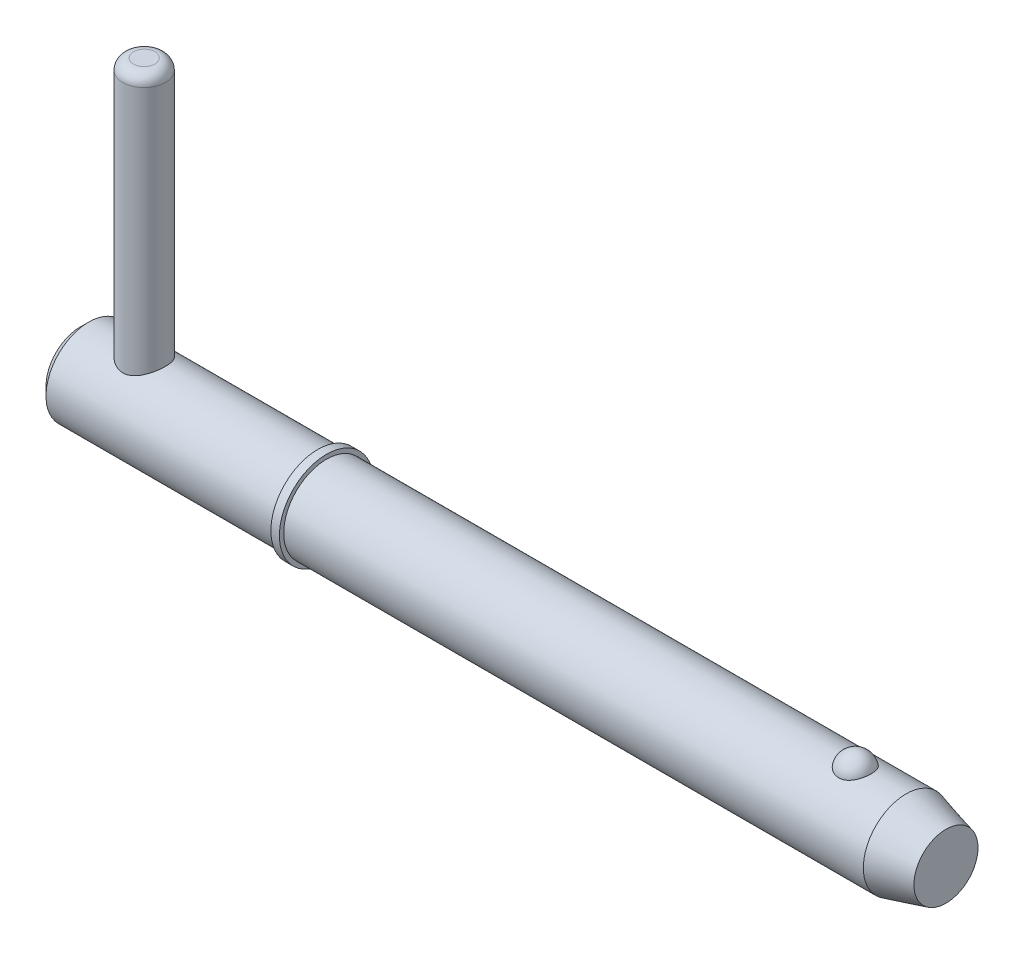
ISO-10303-21;
HEADER;
FILE_DESCRIPTION(('STEP AP214'),'2;1');
FILE_NAME('part.step','',(''),(''),'','','');
FILE_SCHEMA(('AUTOMOTIVE_DESIGN { 1 0 10303 214 1 1 1 1 }'));
ENDSEC;
DATA;
#1=APPLICATION_CONTEXT('core data for automotive mechanical design processes');
#2=APPLICATION_PROTOCOL_DEFINITION('international standard','automotive_design',2000,#1);
#3=PRODUCT_CONTEXT('',#1,'mechanical');
#4=PRODUCT('Part','Part','',(#3));
#5=PRODUCT_RELATED_PRODUCT_CATEGORY('part','',(#4));
#6=PRODUCT_DEFINITION_FORMATION('','',#4);
#7=PRODUCT_DEFINITION_CONTEXT('part definition',#1,'design');
#8=PRODUCT_DEFINITION('design','',#6,#7);
#9=PRODUCT_DEFINITION_SHAPE('','',#8);
#10=(LENGTH_UNIT() NAMED_UNIT(*) SI_UNIT(.MILLI.,.METRE.));
#11=(NAMED_UNIT(*) PLANE_ANGLE_UNIT() SI_UNIT($,.RADIAN.));
#12=(NAMED_UNIT(*) SI_UNIT($,.STERADIAN.) SOLID_ANGLE_UNIT());
#13=UNCERTAINTY_MEASURE_WITH_UNIT(LENGTH_MEASURE(1.E-05),#10,'distance_accuracy_value','');
#14=(GEOMETRIC_REPRESENTATION_CONTEXT(3) GLOBAL_UNCERTAINTY_ASSIGNED_CONTEXT((#13)) GLOBAL_UNIT_ASSIGNED_CONTEXT((#10,
#11,#12)) REPRESENTATION_CONTEXT('',''));
#15=CARTESIAN_POINT('',(0.,0.,0.));
#16=DIRECTION('',(0.,0.,1.));
#17=DIRECTION('',(1.,0.,0.));
#18=AXIS2_PLACEMENT_3D('',#15,#16,#17);
#19=CARTESIAN_POINT('',(4.755,22.225,0.));
#20=DIRECTION('',(0.,-1.,0.));
#21=DIRECTION('',(0.,0.,-1.));
#22=AXIS2_PLACEMENT_3D('',#19,#20,#21);
#23=CYLINDRICAL_SURFACE('',#22,1.585);
#24=CARTESIAN_POINT('',(4.755,-2.3825,0.));
#25=DIRECTION('',(0.,1.,0.));
#26=DIRECTION('',(0.,0.,1.));
#27=AXIS2_PLACEMENT_3D('',#24,#25,#26);
#28=CIRCLE('',#27,1.585);
#29=CARTESIAN_POINT('',(4.755,-2.3825,1.585));
#30=VERTEX_POINT('',#29);
#31=EDGE_CURVE('P0_E25',#30,#30,#28,.T.);
#32=ORIENTED_EDGE('',*,*,#31,.T.);
#33=EDGE_LOOP('',(#32));
#34=FACE_BOUND('',#33,.T.);
#35=CARTESIAN_POINT('',(4.755,21.4325,0.));
#36=DIRECTION('',(0.,1.,0.));
#37=DIRECTION('',(0.,0.,1.));
#38=AXIS2_PLACEMENT_3D('',#35,#36,#37);
#39=CIRCLE('',#38,1.585);
#40=CARTESIAN_POINT('',(4.755,21.4325,1.585));
#41=VERTEX_POINT('',#40);
#42=EDGE_CURVE('P0_E29',#41,#41,#39,.F.);
#43=ORIENTED_EDGE('',*,*,#42,.T.);
#44=EDGE_LOOP('',(#43));
#45=FACE_BOUND('',#44,.T.);
#46=ADVANCED_FACE('P0_F14',(#34,#45),#23,.T.);
#47=CARTESIAN_POINT('',(4.755,22.225,0.));
#48=DIRECTION('',(0.,1.,0.));
#49=DIRECTION('',(0.,0.,1.));
#50=AXIS2_PLACEMENT_3D('',#47,#48,#49);
#51=PLANE('',#50);
#52=CARTESIAN_POINT('',(4.755,22.225,0.));
#53=DIRECTION('',(0.,1.,0.));
#54=DIRECTION('',(0.,0.,1.));
#55=AXIS2_PLACEMENT_3D('',#52,#53,#54);
#56=CIRCLE('',#55,0.7925);
#57=CARTESIAN_POINT('',(4.755,22.225,0.7925));
#58=VERTEX_POINT('',#57);
#59=EDGE_CURVE('P0_E10',#58,#58,#56,.T.);
#60=ORIENTED_EDGE('',*,*,#59,.T.);
#61=EDGE_LOOP('',(#60));
#62=FACE_BOUND('',#61,.T.);
#63=ADVANCED_FACE('P0_F46',(#62),#51,.T.);
#64=CARTESIAN_POINT('',(4.755,-3.175,0.));
#65=DIRECTION('',(0.,1.,0.));
#66=DIRECTION('',(0.,0.,1.));
#67=AXIS2_PLACEMENT_3D('',#64,#65,#66);
#68=PLANE('',#67);
#69=CARTESIAN_POINT('',(4.755,-3.175,0.));
#70=DIRECTION('',(0.,1.,0.));
#71=DIRECTION('',(0.,0.,1.));
#72=AXIS2_PLACEMENT_3D('',#69,#70,#71);
#73=CIRCLE('',#72,0.7925);
#74=CARTESIAN_POINT('',(4.755,-3.175,0.7925));
#75=VERTEX_POINT('',#74);
#76=EDGE_CURVE('P0_E21',#75,#75,#73,.F.);
#77=ORIENTED_EDGE('',*,*,#76,.T.);
#78=EDGE_LOOP('',(#77));
#79=FACE_BOUND('',#78,.T.);
#80=ADVANCED_FACE('P0_F43',(#79),#68,.F.);
#81=CARTESIAN_POINT('',(4.755,-2.3825,0.));
#82=DIRECTION('',(0.,1.,0.));
#83=DIRECTION('',(0.,0.,1.));
#84=AXIS2_PLACEMENT_3D('',#81,#82,#83);
#85=DEGENERATE_TOROIDAL_SURFACE('',#84,0.7925,0.7925,.T.);
#86=ORIENTED_EDGE('',*,*,#76,.F.);
#87=EDGE_LOOP('',(#86));
#88=FACE_BOUND('',#87,.T.);
#89=ORIENTED_EDGE('',*,*,#31,.F.);
#90=EDGE_LOOP('',(#89));
#91=FACE_BOUND('',#90,.T.);
#92=ADVANCED_FACE('P0_F38',(#88,#91),#85,.T.);
#93=CARTESIAN_POINT('',(4.755,21.4325,0.));
#94=DIRECTION('',(0.,1.,0.));
#95=DIRECTION('',(0.,0.,1.));
#96=AXIS2_PLACEMENT_3D('',#93,#94,#95);
#97=DEGENERATE_TOROIDAL_SURFACE('',#96,0.7925,0.7925,.T.);
#98=ORIENTED_EDGE('',*,*,#42,.F.);
#99=EDGE_LOOP('',(#98));
#100=FACE_BOUND('',#99,.T.);
#101=ORIENTED_EDGE('',*,*,#59,.F.);
#102=EDGE_LOOP('',(#101));
#103=FACE_BOUND('',#102,.T.);
#104=ADVANCED_FACE('P0_F16',(#100,#103),#97,.T.);
#105=CLOSED_SHELL('',(#46,#63,#80,#92,#104));
#106=MANIFOLD_SOLID_BREP('P0_B1',#105);
#107=CARTESIAN_POINT('',(0.,0.,0.));
#108=DIRECTION('',(1.,0.,0.));
#109=DIRECTION('',(0.,0.,-1.));
#110=AXIS2_PLACEMENT_3D('',#107,#108,#109);
#111=CYLINDRICAL_SURFACE('',#110,3.175);
#112=CARTESIAN_POINT('',(61.3476846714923,0.,0.));
#113=DIRECTION('',(1.,0.,0.));
#114=DIRECTION('',(0.,0.,-1.));
#115=AXIS2_PLACEMENT_3D('',#112,#113,#114);
#116=CIRCLE('',#115,3.175);
#117=CARTESIAN_POINT('',(61.3476846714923,0.,-3.175));
#118=VERTEX_POINT('',#117);
#119=EDGE_CURVE('P1_E81',#118,#118,#116,.T.);
#120=ORIENTED_EDGE('',*,*,#119,.F.);
#121=EDGE_LOOP('',(#120));
#122=FACE_BOUND('',#121,.T.);
#123=CARTESIAN_POINT('',(18.29,0.,0.));
#124=DIRECTION('',(1.,0.,0.));
#125=DIRECTION('',(0.,0.,-1.));
#126=AXIS2_PLACEMENT_3D('',#123,#124,#125);
#127=CIRCLE('',#126,3.175);
#128=CARTESIAN_POINT('',(18.29,0.,-3.175));
#129=VERTEX_POINT('',#128);
#130=EDGE_CURVE('P1_E85',#129,#129,#127,.T.);
#131=ORIENTED_EDGE('',*,*,#130,.T.);
#132=EDGE_LOOP('',(#131));
#133=FACE_BOUND('',#132,.T.);
#134=CARTESIAN_POINT('',(57.5757276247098,2.92898950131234,1.2254164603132));
#135=CARTESIAN_POINT('',(57.512316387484,2.92899434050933,1.22541146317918));
#136=CARTESIAN_POINT('',(57.4487979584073,2.93112688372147,1.22034641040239));
#137=CARTESIAN_POINT('',(57.3235306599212,2.93942752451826,1.2002094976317));
#138=CARTESIAN_POINT('',(57.2617869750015,2.9456063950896,1.1851109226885));
#139=CARTESIAN_POINT('',(57.1420651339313,2.96127115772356,1.14540352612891));
#140=CARTESIAN_POINT('',(57.0840775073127,2.97074831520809,1.12081980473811));
#141=CARTESIAN_POINT('',(56.9731943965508,2.99197584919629,1.06285154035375));
#142=CARTESIAN_POINT('',(56.9202966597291,3.0037252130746,1.02947091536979));
#143=CARTESIAN_POINT('',(56.8192688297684,3.02865714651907,0.95367409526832));
#144=CARTESIAN_POINT('',(56.771324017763,3.04187163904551,0.911021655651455));
#145=CARTESIAN_POINT('',(56.6830360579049,3.06808741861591,0.818400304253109));
#146=CARTESIAN_POINT('',(56.6426952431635,3.08108863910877,0.768429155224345));
#147=CARTESIAN_POINT('',(56.5688039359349,3.10614903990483,0.660064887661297));
#148=CARTESIAN_POINT('',(56.5356330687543,3.11814104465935,0.601396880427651));
#149=CARTESIAN_POINT('',(56.4791190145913,3.13926931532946,0.47902691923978));
#150=CARTESIAN_POINT('',(56.4557764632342,3.14840539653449,0.415324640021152));
#151=CARTESIAN_POINT('',(56.4191785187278,3.16298160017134,0.283885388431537));
#152=CARTESIAN_POINT('',(56.4060407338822,3.16837855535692,0.21611080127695));
#153=CARTESIAN_POINT('',(56.3905676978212,3.17475386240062,0.0791367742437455));
#154=CARTESIAN_POINT('',(56.388232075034,3.17573236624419,0.00993738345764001));
#155=CARTESIAN_POINT('',(56.3943886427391,3.17318075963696,-0.127420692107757));
#156=CARTESIAN_POINT('',(56.4028073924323,3.16968122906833,-0.195583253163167));
#157=CARTESIAN_POINT('',(56.4301752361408,3.1585790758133,-0.329413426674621));
#158=CARTESIAN_POINT('',(56.4491245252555,3.15097637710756,-0.395080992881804));
#159=CARTESIAN_POINT('',(56.4972057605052,3.13242485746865,-0.522180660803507));
#160=CARTESIAN_POINT('',(56.5263524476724,3.12147119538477,-0.583606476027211));
#161=CARTESIAN_POINT('',(56.5942352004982,3.09734973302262,-0.700436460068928));
#162=CARTESIAN_POINT('',(56.632972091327,3.08418174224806,-0.7558401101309));
#163=CARTESIAN_POINT('',(56.7194771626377,3.05694884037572,-0.859404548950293));
#164=CARTESIAN_POINT('',(56.7672961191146,3.04287919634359,-0.907521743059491));
#165=CARTESIAN_POINT('',(56.8707353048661,3.01548927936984,-0.994758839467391));
#166=CARTESIAN_POINT('',(56.9263549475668,3.0021689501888,-1.03387941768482));
#167=CARTESIAN_POINT('',(57.0428093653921,2.97810316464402,-1.10126594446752));
#168=CARTESIAN_POINT('',(57.1035182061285,2.96731170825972,-1.12973256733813));
#169=CARTESIAN_POINT('',(57.2293712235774,2.94928934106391,-1.17598467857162));
#170=CARTESIAN_POINT('',(57.2945137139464,2.94205708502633,-1.19377420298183));
#171=CARTESIAN_POINT('',(57.4238562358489,2.93233065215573,-1.21746387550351));
#172=CARTESIAN_POINT('',(57.4879385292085,2.92961621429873,-1.22391763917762));
#173=CARTESIAN_POINT('',(57.6163375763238,2.92855752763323,-1.22644976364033));
#174=CARTESIAN_POINT('',(57.6806542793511,2.93021238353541,-1.22253024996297));
#175=CARTESIAN_POINT('',(57.8055239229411,2.93756851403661,-1.20474140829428));
#176=CARTESIAN_POINT('',(57.866131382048,2.94313790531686,-1.1911962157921));
#177=CARTESIAN_POINT('',(57.9841106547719,2.95756226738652,-1.15491492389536));
#178=CARTESIAN_POINT('',(58.0414822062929,2.96641750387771,-1.13217808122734));
#179=CARTESIAN_POINT('',(58.1527699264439,2.98669918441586,-1.07755083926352));
#180=CARTESIAN_POINT('',(58.2065845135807,2.9981771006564,-1.04547308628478));
#181=CARTESIAN_POINT('',(58.3081473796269,3.02240235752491,-0.973220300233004));
#182=CARTESIAN_POINT('',(58.3558942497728,3.03514999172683,-0.933043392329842));
#183=CARTESIAN_POINT('',(58.4465817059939,3.06131230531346,-0.843372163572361));
#184=CARTESIAN_POINT('',(58.4891588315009,3.07472822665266,-0.793510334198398));
#185=CARTESIAN_POINT('',(58.5656765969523,3.10021106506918,-0.687241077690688));
#186=CARTESIAN_POINT('',(58.5996156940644,3.1122777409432,-0.630832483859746));
#187=CARTESIAN_POINT('',(58.6591209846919,3.134208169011,-0.511059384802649));
#188=CARTESIAN_POINT('',(58.6843892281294,3.14399040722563,-0.447531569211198));
#189=CARTESIAN_POINT('',(58.7245117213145,3.15983820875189,-0.316827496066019));
#190=CARTESIAN_POINT('',(58.7393659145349,3.16590375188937,-0.249651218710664));
#191=CARTESIAN_POINT('',(58.758358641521,3.17370076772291,-0.113549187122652));
#192=CARTESIAN_POINT('',(58.7624966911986,3.17543204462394,-0.0446233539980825));
#193=CARTESIAN_POINT('',(58.7599697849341,3.17438372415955,0.0929938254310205));
#194=CARTESIAN_POINT('',(58.7533050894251,3.17160423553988,0.16168517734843));
#195=CARTESIAN_POINT('',(58.7293754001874,3.1618438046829,0.296502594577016));
#196=CARTESIAN_POINT('',(58.7121674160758,3.15488546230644,0.362640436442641));
#197=CARTESIAN_POINT('',(58.667547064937,3.13748892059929,0.490896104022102));
#198=CARTESIAN_POINT('',(58.6401339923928,3.12705048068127,0.553013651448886));
#199=CARTESIAN_POINT('',(58.5754626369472,3.10369139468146,0.671876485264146));
#200=CARTESIAN_POINT('',(58.5381467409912,3.0907563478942,0.728587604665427));
#201=CARTESIAN_POINT('',(58.4545246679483,3.06381731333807,0.834653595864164));
#202=CARTESIAN_POINT('',(58.4082189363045,3.04981337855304,0.884008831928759));
#203=CARTESIAN_POINT('',(58.3077184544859,3.02230423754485,0.973916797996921));
#204=CARTESIAN_POINT('',(58.253535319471,3.00879833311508,1.01448227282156));
#205=CARTESIAN_POINT('',(58.1385299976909,2.98383625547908,1.0857155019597));
#206=CARTESIAN_POINT('',(58.0777053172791,2.9723808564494,1.11637952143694));
#207=CARTESIAN_POINT('',(57.9533690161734,2.95329063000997,1.16592590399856));
#208=CARTESIAN_POINT('',(57.8900230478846,2.9455373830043,1.18517901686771));
#209=CARTESIAN_POINT('',(57.7607664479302,2.9342556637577,1.21284802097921));
#210=CARTESIAN_POINT('',(57.6948641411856,2.93071450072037,1.22129647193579));
#211=CARTESIAN_POINT('',(57.611116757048,2.9291525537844,1.22502505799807));
#212=CARTESIAN_POINT('',(57.5934263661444,2.9289881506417,1.22541785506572));
#213=CARTESIAN_POINT('',(57.5757276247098,2.92898950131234,1.2254164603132));
#214=B_SPLINE_CURVE_WITH_KNOTS('',3,(#134,#135,#136,#137,#138,#139,#140,#141,#142,#143,#144,
#145,#146,#147,#148,#149,#150,#151,#152,#153,#154,#155,#156,#157,#158,#159,#160,#161,#162,#163,
#164,#165,#166,#167,#168,#169,#170,#171,#172,#173,#174,#175,#176,#177,#178,#179,#180,#181,#182,
#183,#184,#185,#186,#187,#188,#189,#190,#191,#192,#193,#194,#195,#196,#197,#198,#199,#200,#201,
#202,#203,#204,#205,#206,#207,#208,#209,#210,#211,#212,#213),.UNSPECIFIED.,.T.,.F.,(4,2,2,2,2,2,
2,2,2,2,2,2,2,2,2,2,2,2,2,2,2,2,2,2,2,2,2,2,2,2,2,2,2,2,2,2,2,2,2,4),(0.,0.190186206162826,
0.380880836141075,0.571074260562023,0.761183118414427,0.95686644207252,1.1526097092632,
1.35701770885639,1.56143892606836,1.76818248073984,1.97491892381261,2.18025109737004,
2.38558707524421,2.59122111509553,2.79687285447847,3.00371012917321,3.21053185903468,
3.41323429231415,3.61586005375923,3.80828192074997,4.00066436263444,4.18685798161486,
4.37306665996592,4.56330302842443,4.75358348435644,4.95345287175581,5.15335793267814,
5.35957003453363,5.56578325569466,5.77200579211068,5.97822335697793,6.18333558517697,
6.38846199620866,6.59480900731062,6.80114579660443,7.0071813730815,7.21329457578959,
7.41228022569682,7.61066481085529,7.66374777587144),.UNSPECIFIED.);
#215=CARTESIAN_POINT('',(57.5757276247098,2.92898950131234,1.2254164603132));
#216=VERTEX_POINT('',#215);
#217=EDGE_CURVE('P1_E35',#216,#216,#214,.T.);
#218=ORIENTED_EDGE('',*,*,#217,.T.);
#219=EDGE_LOOP('',(#218));
#220=FACE_BOUND('',#219,.T.);
#221=ADVANCED_FACE('P1_F13',(#122,#133,#220),#111,.T.);
#222=CARTESIAN_POINT('',(0.,0.,0.));
#223=DIRECTION('',(-1.,0.,0.));
#224=DIRECTION('',(0.,0.,1.));
#225=AXIS2_PLACEMENT_3D('',#222,#223,#224);
#226=PLANE('',#225);
#227=CARTESIAN_POINT('',(0.,0.,0.));
#228=DIRECTION('',(1.,0.,0.));
#229=DIRECTION('',(0.,0.,-1.));
#230=AXIS2_PLACEMENT_3D('',#227,#228,#229);
#231=CIRCLE('',#230,2.54);
#232=CARTESIAN_POINT('',(0.,0.,-2.54));
#233=VERTEX_POINT('',#232);
#234=EDGE_CURVE('P1_E9',#233,#233,#231,.T.);
#235=ORIENTED_EDGE('',*,*,#234,.F.);
#236=EDGE_LOOP('',(#235));
#237=FACE_BOUND('',#236,.T.);
#238=ADVANCED_FACE('P1_F15',(#237),#226,.T.);
#239=CARTESIAN_POINT('',(0.634999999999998,0.,0.));
#240=DIRECTION('',(1.,0.,0.));
#241=DIRECTION('',(0.,0.,-1.));
#242=AXIS2_PLACEMENT_3D('',#239,#240,#241);
#243=CONICAL_SURFACE('',#242,3.175,0.78539816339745);
#244=ORIENTED_EDGE('',*,*,#234,.T.);
#245=EDGE_LOOP('',(#244));
#246=FACE_BOUND('',#245,.T.);
#247=CARTESIAN_POINT('',(0.634999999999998,0.,0.));
#248=DIRECTION('',(1.,0.,0.));
#249=DIRECTION('',(0.,0.,-1.));
#250=AXIS2_PLACEMENT_3D('',#247,#248,#249);
#251=CIRCLE('',#250,3.175);
#252=CARTESIAN_POINT('',(0.634999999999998,0.,-3.175));
#253=VERTEX_POINT('',#252);
#254=EDGE_CURVE('P1_E26',#253,#253,#251,.T.);
#255=ORIENTED_EDGE('',*,*,#254,.F.);
#256=EDGE_LOOP('',(#255));
#257=FACE_BOUND('',#256,.T.);
#258=ADVANCED_FACE('P1_F77',(#246,#257),#243,.T.);
#259=CARTESIAN_POINT('',(0.,0.,0.));
#260=DIRECTION('',(1.,0.,0.));
#261=DIRECTION('',(0.,0.,-1.));
#262=AXIS2_PLACEMENT_3D('',#259,#260,#261);
#263=CYLINDRICAL_SURFACE('',#262,3.175);
#264=CARTESIAN_POINT('',(4.755,-2.75107251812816,1.585));
#265=CARTESIAN_POINT('',(4.67238891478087,-2.7510796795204,1.58499425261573));
#266=CARTESIAN_POINT('',(4.58967306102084,-2.75485010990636,1.57849830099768));
#267=CARTESIAN_POINT('',(4.42677850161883,-2.76938647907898,1.55284486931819));
#268=CARTESIAN_POINT('',(4.34660551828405,-2.78016716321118,1.53366069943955));
#269=CARTESIAN_POINT('',(4.19146029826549,-2.80716278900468,1.48366329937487));
#270=CARTESIAN_POINT('',(4.11646293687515,-2.8233488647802,1.45291173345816));
#271=CARTESIAN_POINT('',(3.97271079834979,-2.85928672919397,1.38084067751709));
#272=CARTESIAN_POINT('',(3.90395634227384,-2.87903870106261,1.33952064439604));
#273=CARTESIAN_POINT('',(3.76839976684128,-2.921867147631,1.24350234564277));
#274=CARTESIAN_POINT('',(3.702222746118,-2.94508343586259,1.18798355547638));
#275=CARTESIAN_POINT('',(3.5796334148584,-2.99109588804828,1.06685014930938));
#276=CARTESIAN_POINT('',(3.52322596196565,-3.01389183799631,1.00123054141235));
#277=CARTESIAN_POINT('',(3.41807024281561,-3.05832598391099,0.856373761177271));
#278=CARTESIAN_POINT('',(3.37009053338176,-3.07978367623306,0.776518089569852));
#279=CARTESIAN_POINT('',(3.28853137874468,-3.11730894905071,0.608596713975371));
#280=CARTESIAN_POINT('',(3.25494287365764,-3.1333799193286,0.520536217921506));
#281=CARTESIAN_POINT('',(3.20559401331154,-3.15731341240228,0.345327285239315));
#282=CARTESIAN_POINT('',(3.18873760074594,-3.16567752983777,0.258557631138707));
#283=CARTESIAN_POINT('',(3.16972238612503,-3.17512718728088,0.0830496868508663));
#284=CARTESIAN_POINT('',(3.16755472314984,-3.17621711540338,-0.00568738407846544));
#285=CARTESIAN_POINT('',(3.1775542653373,-3.17123385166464,-0.174372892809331));
#286=CARTESIAN_POINT('',(3.18849502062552,-3.16577346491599,-0.254416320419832));
#287=CARTESIAN_POINT('',(3.22220680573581,-3.14922844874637,-0.411354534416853));
#288=CARTESIAN_POINT('',(3.2449787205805,-3.13814339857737,-0.488249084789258));
#289=CARTESIAN_POINT('',(3.30185558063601,-3.111172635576,-0.638050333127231));
#290=CARTESIAN_POINT('',(3.33611332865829,-3.09522247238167,-0.710886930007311));
#291=CARTESIAN_POINT('',(3.41477890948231,-3.05996035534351,-0.849953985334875));
#292=CARTESIAN_POINT('',(3.45919037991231,-3.04064719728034,-0.916182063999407));
#293=CARTESIAN_POINT('',(3.5617148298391,-2.99832415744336,-1.04681642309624));
#294=CARTESIAN_POINT('',(3.62072497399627,-2.97513741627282,-1.11046186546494));
#295=CARTESIAN_POINT('',(3.7483697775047,-2.92885066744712,-1.22736291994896));
#296=CARTESIAN_POINT('',(3.81701173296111,-2.90575073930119,-1.2806105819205));
#297=CARTESIAN_POINT('',(3.96727993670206,-2.86067370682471,-1.37849835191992));
#298=CARTESIAN_POINT('',(4.04945242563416,-2.83885964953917,-1.42238246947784));
#299=CARTESIAN_POINT('',(4.2213558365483,-2.80110454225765,-1.49537418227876));
#300=CARTESIAN_POINT('',(4.3110787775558,-2.78515738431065,-1.52449715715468));
#301=CARTESIAN_POINT('',(4.48806324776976,-2.76271292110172,-1.56478065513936));
#302=CARTESIAN_POINT('',(4.57495732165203,-2.75556745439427,-1.57718067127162));
#303=CARTESIAN_POINT('',(4.74985771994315,-2.74969306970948,-1.58740564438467));
#304=CARTESIAN_POINT('',(4.8378632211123,-2.75095824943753,-1.58524082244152));
#305=CARTESIAN_POINT('',(5.00227282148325,-2.76107477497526,-1.56753530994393));
#306=CARTESIAN_POINT('',(5.07889680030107,-2.76908515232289,-1.55347662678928));
#307=CARTESIAN_POINT('',(5.22855309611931,-2.79054849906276,-1.51458035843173));
#308=CARTESIAN_POINT('',(5.30158424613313,-2.80400322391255,-1.489739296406));
#309=CARTESIAN_POINT('',(5.44583114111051,-2.83556995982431,-1.42877335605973));
#310=CARTESIAN_POINT('',(5.51680600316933,-2.85386886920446,-1.39217900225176));
#311=CARTESIAN_POINT('',(5.6520174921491,-2.89289503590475,-1.30915485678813));
#312=CARTESIAN_POINT('',(5.71625063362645,-2.91362353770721,-1.26272001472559));
#313=CARTESIAN_POINT('',(5.8445938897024,-2.95830220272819,-1.15451693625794));
#314=CARTESIAN_POINT('',(5.90767560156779,-2.98233004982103,-1.09155543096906));
#315=CARTESIAN_POINT('',(6.0226995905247,-3.02864458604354,-0.955560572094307));
#316=CARTESIAN_POINT('',(6.07463814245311,-3.05093069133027,-0.882523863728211));
#317=CARTESIAN_POINT('',(6.16704288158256,-3.09200671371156,-0.725836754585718));
#318=CARTESIAN_POINT('',(6.20717458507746,-3.11069030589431,-0.64195924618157));
#319=CARTESIAN_POINT('',(6.27235859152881,-3.1416474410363,-0.467442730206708));
#320=CARTESIAN_POINT('',(6.29742409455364,-3.15392659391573,-0.376809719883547));
#321=CARTESIAN_POINT('',(6.32960989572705,-3.16979844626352,-0.200314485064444));
#322=CARTESIAN_POINT('',(6.33816324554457,-3.17408359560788,-0.114775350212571));
#323=CARTESIAN_POINT('',(6.34130309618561,-3.17565001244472,0.0566108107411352));
#324=CARTESIAN_POINT('',(6.33589445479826,-3.17293371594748,0.142457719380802));
#325=CARTESIAN_POINT('',(6.31221457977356,-3.16120608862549,0.306097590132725));
#326=CARTESIAN_POINT('',(6.2948097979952,-3.15261910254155,0.38404960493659));
#327=CARTESIAN_POINT('',(6.24879775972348,-3.13040364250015,0.535801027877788));
#328=CARTESIAN_POINT('',(6.22018889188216,-3.11677444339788,0.609599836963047));
#329=CARTESIAN_POINT('',(6.15130303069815,-3.08497808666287,0.754502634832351));
#330=CARTESIAN_POINT('',(6.11057850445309,-3.0666414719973,0.82535556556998));
#331=CARTESIAN_POINT('',(6.01917980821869,-3.02735012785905,0.95951596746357));
#332=CARTESIAN_POINT('',(5.96850106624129,-3.00639419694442,1.02281994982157));
#333=CARTESIAN_POINT('',(5.8528006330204,-2.96149402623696,1.1467073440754));
#334=CARTESIAN_POINT('',(5.78685463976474,-2.93745961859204,1.20639723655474));
#335=CARTESIAN_POINT('',(5.64552278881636,-2.89084502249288,1.31419099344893));
#336=CARTESIAN_POINT('',(5.57012871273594,-2.8682661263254,1.36228466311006));
#337=CARTESIAN_POINT('',(5.40892145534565,-2.82661780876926,1.44677201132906));
#338=CARTESIAN_POINT('',(5.32285703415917,-2.80767948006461,1.48275497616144));
#339=CARTESIAN_POINT('',(5.14469010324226,-2.77716572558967,1.53916557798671));
#340=CARTESIAN_POINT('',(5.05260892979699,-2.76556569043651,1.55964525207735));
#341=CARTESIAN_POINT('',(4.92544162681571,-2.75613775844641,1.57618070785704));
#342=CARTESIAN_POINT('',(4.89147210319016,-2.75424493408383,1.57948285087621));
#343=CARTESIAN_POINT('',(4.82334103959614,-2.75171079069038,1.58389375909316));
#344=CARTESIAN_POINT('',(4.78917948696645,-2.75106955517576,1.58500237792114));
#345=CARTESIAN_POINT('',(4.755,-2.75107251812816,1.585));
#346=B_SPLINE_CURVE_WITH_KNOTS('',3,(#264,#265,#266,#267,#268,#269,#270,#271,#272,#273,#274,
#275,#276,#277,#278,#279,#280,#281,#282,#283,#284,#285,#286,#287,#288,#289,#290,#291,#292,#293,
#294,#295,#296,#297,#298,#299,#300,#301,#302,#303,#304,#305,#306,#307,#308,#309,#310,#311,#312,
#313,#314,#315,#316,#317,#318,#319,#320,#321,#322,#323,#324,#325,#326,#327,#328,#329,#330,#331,
#332,#333,#334,#335,#336,#337,#338,#339,#340,#341,#342,#343,#344,#345),.UNSPECIFIED.,.T.,.F.,(4,
2,2,2,2,2,2,2,2,2,2,2,2,2,2,2,2,2,2,2,2,2,2,2,2,2,2,2,2,2,2,2,2,2,2,2,2,2,2,2,4),(0.,
0.247689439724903,0.495901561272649,0.742808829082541,0.989728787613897,1.25694656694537,
1.52429683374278,1.80959781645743,2.0947189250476,2.35960564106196,2.62433255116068,
2.86610932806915,3.1079041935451,3.35305262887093,3.59828902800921,3.86665310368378,
4.13522157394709,4.4207514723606,4.70598326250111,4.9686344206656,5.23110127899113,
5.46499114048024,5.69895647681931,5.94376186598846,6.1886932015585,6.46438263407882,
6.74016408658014,7.0231370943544,7.30586181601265,7.5626977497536,7.81944433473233,
8.05935987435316,8.29930993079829,8.54954401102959,8.79989329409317,9.07508848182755,
9.35052473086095,9.63453318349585,9.91758407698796,10.0200561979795,10.1225351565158),.UNSPECIFIED.);
#347=CARTESIAN_POINT('',(4.755,-2.75107251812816,1.585));
#348=VERTEX_POINT('',#347);
#349=EDGE_CURVE('P1_E17',#348,#348,#346,.T.);
#350=ORIENTED_EDGE('',*,*,#349,.F.);
#351=EDGE_LOOP('',(#350));
#352=FACE_BOUND('',#351,.T.);
#353=CARTESIAN_POINT('',(4.755,2.75107251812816,1.585));
#354=CARTESIAN_POINT('',(4.83761108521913,2.7510796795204,1.58499425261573));
#355=CARTESIAN_POINT('',(4.92032693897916,2.75485010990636,1.57849830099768));
#356=CARTESIAN_POINT('',(5.08322149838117,2.76938647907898,1.55284486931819));
#357=CARTESIAN_POINT('',(5.16339448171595,2.78016716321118,1.53366069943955));
#358=CARTESIAN_POINT('',(5.31853970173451,2.80716278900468,1.48366329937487));
#359=CARTESIAN_POINT('',(5.39353706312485,2.8233488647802,1.45291173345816));
#360=CARTESIAN_POINT('',(5.53728920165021,2.85928672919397,1.38084067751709));
#361=CARTESIAN_POINT('',(5.60604365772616,2.87903870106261,1.33952064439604));
#362=CARTESIAN_POINT('',(5.74160023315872,2.921867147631,1.24350234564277));
#363=CARTESIAN_POINT('',(5.807777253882,2.94508343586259,1.18798355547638));
#364=CARTESIAN_POINT('',(5.9303665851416,2.99109588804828,1.06685014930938));
#365=CARTESIAN_POINT('',(5.98677403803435,3.01389183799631,1.00123054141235));
#366=CARTESIAN_POINT('',(6.09192975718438,3.05832598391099,0.85637376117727));
#367=CARTESIAN_POINT('',(6.13990946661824,3.07978367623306,0.776518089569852));
#368=CARTESIAN_POINT('',(6.22146862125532,3.11730894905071,0.608596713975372));
#369=CARTESIAN_POINT('',(6.25505712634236,3.1333799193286,0.520536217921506));
#370=CARTESIAN_POINT('',(6.30440598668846,3.15731341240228,0.345327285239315));
#371=CARTESIAN_POINT('',(6.32126239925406,3.16567752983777,0.258557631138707));
#372=CARTESIAN_POINT('',(6.34027761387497,3.17512718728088,0.0830496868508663));
#373=CARTESIAN_POINT('',(6.34244527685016,3.17621711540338,-0.00568738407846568));
#374=CARTESIAN_POINT('',(6.3324457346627,3.17123385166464,-0.174372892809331));
#375=CARTESIAN_POINT('',(6.32150497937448,3.16577346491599,-0.254416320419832));
#376=CARTESIAN_POINT('',(6.28779319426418,3.14922844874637,-0.411354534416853));
#377=CARTESIAN_POINT('',(6.2650212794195,3.13814339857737,-0.488249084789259));
#378=CARTESIAN_POINT('',(6.20814441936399,3.111172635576,-0.638050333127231));
#379=CARTESIAN_POINT('',(6.17388667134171,3.09522247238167,-0.710886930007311));
#380=CARTESIAN_POINT('',(6.09522109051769,3.05996035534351,-0.849953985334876));
#381=CARTESIAN_POINT('',(6.05080962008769,3.04064719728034,-0.916182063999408));
#382=CARTESIAN_POINT('',(5.9482851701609,2.99832415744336,-1.04681642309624));
#383=CARTESIAN_POINT('',(5.88927502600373,2.97513741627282,-1.11046186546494));
#384=CARTESIAN_POINT('',(5.7616302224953,2.92885066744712,-1.22736291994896));
#385=CARTESIAN_POINT('',(5.69298826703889,2.90575073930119,-1.2806105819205));
#386=CARTESIAN_POINT('',(5.54272006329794,2.86067370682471,-1.37849835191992));
#387=CARTESIAN_POINT('',(5.46054757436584,2.83885964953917,-1.42238246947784));
#388=CARTESIAN_POINT('',(5.2886441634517,2.80110454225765,-1.49537418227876));
#389=CARTESIAN_POINT('',(5.19892122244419,2.78515738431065,-1.52449715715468));
#390=CARTESIAN_POINT('',(5.02193675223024,2.76271292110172,-1.56478065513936));
#391=CARTESIAN_POINT('',(4.93504267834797,2.75556745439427,-1.57718067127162));
#392=CARTESIAN_POINT('',(4.76014228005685,2.74969306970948,-1.58740564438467));
#393=CARTESIAN_POINT('',(4.6721367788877,2.75095824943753,-1.58524082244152));
#394=CARTESIAN_POINT('',(4.50772717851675,2.76107477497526,-1.56753530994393));
#395=CARTESIAN_POINT('',(4.43110319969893,2.76908515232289,-1.55347662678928));
#396=CARTESIAN_POINT('',(4.28144690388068,2.79054849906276,-1.51458035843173));
#397=CARTESIAN_POINT('',(4.20841575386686,2.80400322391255,-1.489739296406));
#398=CARTESIAN_POINT('',(4.06416885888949,2.83556995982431,-1.42877335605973));
#399=CARTESIAN_POINT('',(3.99319399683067,2.85386886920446,-1.39217900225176));
#400=CARTESIAN_POINT('',(3.8579825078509,2.89289503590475,-1.30915485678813));
#401=CARTESIAN_POINT('',(3.79374936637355,2.91362353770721,-1.26272001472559));
#402=CARTESIAN_POINT('',(3.6654061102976,2.95830220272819,-1.15451693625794));
#403=CARTESIAN_POINT('',(3.60232439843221,2.98233004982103,-1.09155543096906));
#404=CARTESIAN_POINT('',(3.4873004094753,3.02864458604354,-0.955560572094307));
#405=CARTESIAN_POINT('',(3.43536185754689,3.05093069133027,-0.88252386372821));
#406=CARTESIAN_POINT('',(3.34295711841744,3.09200671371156,-0.725836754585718));
#407=CARTESIAN_POINT('',(3.30282541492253,3.11069030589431,-0.64195924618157));
#408=CARTESIAN_POINT('',(3.23764140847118,3.14164744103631,-0.467442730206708));
#409=CARTESIAN_POINT('',(3.21257590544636,3.15392659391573,-0.376809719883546));
#410=CARTESIAN_POINT('',(3.18039010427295,3.16979844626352,-0.200314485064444));
#411=CARTESIAN_POINT('',(3.17183675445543,3.17408359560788,-0.114775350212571));
#412=CARTESIAN_POINT('',(3.16869690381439,3.17565001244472,0.0566108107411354));
#413=CARTESIAN_POINT('',(3.17410554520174,3.17293371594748,0.142457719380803));
#414=CARTESIAN_POINT('',(3.19778542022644,3.16120608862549,0.306097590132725));
#415=CARTESIAN_POINT('',(3.2151902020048,3.15261910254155,0.384049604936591));
#416=CARTESIAN_POINT('',(3.26120224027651,3.13040364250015,0.535801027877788));
#417=CARTESIAN_POINT('',(3.28981110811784,3.11677444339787,0.609599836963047));
#418=CARTESIAN_POINT('',(3.35869696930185,3.08497808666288,0.754502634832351));
#419=CARTESIAN_POINT('',(3.39942149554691,3.0666414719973,0.82535556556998));
#420=CARTESIAN_POINT('',(3.49082019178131,3.02735012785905,0.95951596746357));
#421=CARTESIAN_POINT('',(3.54149893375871,3.00639419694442,1.02281994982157));
#422=CARTESIAN_POINT('',(3.6571993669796,2.96149402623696,1.1467073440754));
#423=CARTESIAN_POINT('',(3.72314536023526,2.93745961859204,1.20639723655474));
#424=CARTESIAN_POINT('',(3.86447721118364,2.89084502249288,1.31419099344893));
#425=CARTESIAN_POINT('',(3.93987128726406,2.8682661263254,1.36228466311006));
#426=CARTESIAN_POINT('',(4.10107854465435,2.82661780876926,1.44677201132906));
#427=CARTESIAN_POINT('',(4.18714296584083,2.80767948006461,1.48275497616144));
#428=CARTESIAN_POINT('',(4.36530989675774,2.77716572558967,1.53916557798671));
#429=CARTESIAN_POINT('',(4.45739107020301,2.76556569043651,1.55964525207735));
#430=CARTESIAN_POINT('',(4.58455837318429,2.75613775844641,1.57618070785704));
#431=CARTESIAN_POINT('',(4.61852789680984,2.75424493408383,1.57948285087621));
#432=CARTESIAN_POINT('',(4.68665896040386,2.75171079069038,1.58389375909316));
#433=CARTESIAN_POINT('',(4.72082051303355,2.75106955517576,1.58500237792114));
#434=CARTESIAN_POINT('',(4.755,2.75107251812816,1.585));
#435=B_SPLINE_CURVE_WITH_KNOTS('',3,(#353,#354,#355,#356,#357,#358,#359,#360,#361,#362,#363,
#364,#365,#366,#367,#368,#369,#370,#371,#372,#373,#374,#375,#376,#377,#378,#379,#380,#381,#382,
#383,#384,#385,#386,#387,#388,#389,#390,#391,#392,#393,#394,#395,#396,#397,#398,#399,#400,#401,
#402,#403,#404,#405,#406,#407,#408,#409,#410,#411,#412,#413,#414,#415,#416,#417,#418,#419,#420,
#421,#422,#423,#424,#425,#426,#427,#428,#429,#430,#431,#432,#433,#434),.UNSPECIFIED.,.T.,.F.,(4,
2,2,2,2,2,2,2,2,2,2,2,2,2,2,2,2,2,2,2,2,2,2,2,2,2,2,2,2,2,2,2,2,2,2,2,2,2,2,2,4),(0.,
0.247689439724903,0.495901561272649,0.742808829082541,0.989728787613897,1.25694656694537,
1.52429683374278,1.80959781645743,2.0947189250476,2.35960564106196,2.62433255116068,
2.86610932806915,3.1079041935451,3.35305262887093,3.59828902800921,3.86665310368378,
4.13522157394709,4.4207514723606,4.70598326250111,4.9686344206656,5.23110127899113,
5.46499114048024,5.69895647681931,5.94376186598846,6.1886932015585,6.46438263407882,
6.74016408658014,7.0231370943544,7.30586181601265,7.5626977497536,7.81944433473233,
8.05935987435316,8.29930993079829,8.54954401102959,8.79989329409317,9.07508848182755,
9.35052473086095,9.63453318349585,9.91758407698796,10.0200561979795,10.1225351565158),.UNSPECIFIED.);
#436=CARTESIAN_POINT('',(4.755,2.75107251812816,1.585));
#437=VERTEX_POINT('',#436);
#438=EDGE_CURVE('P1_E43',#437,#437,#435,.T.);
#439=ORIENTED_EDGE('',*,*,#438,.F.);
#440=EDGE_LOOP('',(#439));
#441=FACE_BOUND('',#440,.T.);
#442=ORIENTED_EDGE('',*,*,#254,.T.);
#443=EDGE_LOOP('',(#442));
#444=FACE_BOUND('',#443,.T.);
#445=CARTESIAN_POINT('',(17.655,0.,0.));
#446=DIRECTION('',(1.,0.,0.));
#447=DIRECTION('',(0.,0.,-1.));
#448=AXIS2_PLACEMENT_3D('',#445,#446,#447);
#449=CIRCLE('',#448,3.175);
#450=CARTESIAN_POINT('',(17.655,0.,-3.175));
#451=VERTEX_POINT('',#450);
#452=EDGE_CURVE('P1_E31',#451,#451,#449,.T.);
#453=ORIENTED_EDGE('',*,*,#452,.F.);
#454=EDGE_LOOP('',(#453));
#455=FACE_BOUND('',#454,.T.);
#456=ADVANCED_FACE('P1_F103',(#352,#441,#444,#455),#263,.T.);
#457=CARTESIAN_POINT('',(17.655,3.175,0.));
#458=DIRECTION('',(-1.,0.,0.));
#459=DIRECTION('',(0.,0.,1.));
#460=AXIS2_PLACEMENT_3D('',#457,#458,#459);
#461=PLANE('',#460);
#462=ORIENTED_EDGE('',*,*,#452,.T.);
#463=EDGE_LOOP('',(#462));
#464=FACE_BOUND('',#463,.T.);
#465=CARTESIAN_POINT('',(17.655,0.,0.));
#466=DIRECTION('',(1.,0.,0.));
#467=DIRECTION('',(0.,0.,-1.));
#468=AXIS2_PLACEMENT_3D('',#465,#466,#467);
#469=CIRCLE('',#468,3.4925);
#470=CARTESIAN_POINT('',(17.655,0.,-3.4925));
#471=VERTEX_POINT('',#470);
#472=EDGE_CURVE('P1_E91',#471,#471,#469,.T.);
#473=ORIENTED_EDGE('',*,*,#472,.F.);
#474=EDGE_LOOP('',(#473));
#475=FACE_BOUND('',#474,.T.);
#476=ADVANCED_FACE('P1_F100',(#464,#475),#461,.T.);
#477=CARTESIAN_POINT('',(0.,0.,0.));
#478=DIRECTION('',(1.,0.,0.));
#479=DIRECTION('',(0.,0.,-1.));
#480=AXIS2_PLACEMENT_3D('',#477,#478,#479);
#481=CYLINDRICAL_SURFACE('',#480,3.4925);
#482=ORIENTED_EDGE('',*,*,#472,.T.);
#483=EDGE_LOOP('',(#482));
#484=FACE_BOUND('',#483,.T.);
#485=CARTESIAN_POINT('',(18.29,0.,0.));
#486=DIRECTION('',(1.,0.,0.));
#487=DIRECTION('',(0.,0.,-1.));
#488=AXIS2_PLACEMENT_3D('',#485,#486,#487);
#489=CIRCLE('',#488,3.4925);
#490=CARTESIAN_POINT('',(18.29,0.,-3.4925));
#491=VERTEX_POINT('',#490);
#492=EDGE_CURVE('P1_E88',#491,#491,#489,.T.);
#493=ORIENTED_EDGE('',*,*,#492,.F.);
#494=EDGE_LOOP('',(#493));
#495=FACE_BOUND('',#494,.T.);
#496=ADVANCED_FACE('P1_F68',(#484,#495),#481,.T.);
#497=CARTESIAN_POINT('',(18.29,3.4925,0.));
#498=DIRECTION('',(1.,0.,0.));
#499=DIRECTION('',(0.,0.,-1.));
#500=AXIS2_PLACEMENT_3D('',#497,#498,#499);
#501=PLANE('',#500);
#502=ORIENTED_EDGE('',*,*,#492,.T.);
#503=EDGE_LOOP('',(#502));
#504=FACE_BOUND('',#503,.T.);
#505=ORIENTED_EDGE('',*,*,#130,.F.);
#506=EDGE_LOOP('',(#505));
#507=FACE_BOUND('',#506,.T.);
#508=ADVANCED_FACE('P1_F62',(#504,#507),#501,.T.);
#509=CARTESIAN_POINT('',(64.31,0.,0.));
#510=DIRECTION('',(-1.,0.,0.));
#511=DIRECTION('',(0.,0.,1.));
#512=AXIS2_PLACEMENT_3D('',#509,#510,#511);
#513=CONICAL_SURFACE('',#512,2.38125000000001,0.26179938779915);
#514=ORIENTED_EDGE('',*,*,#119,.T.);
#515=EDGE_LOOP('',(#514));
#516=FACE_BOUND('',#515,.T.);
#517=CARTESIAN_POINT('',(64.31,0.,0.));
#518=DIRECTION('',(1.,0.,0.));
#519=DIRECTION('',(0.,0.,-1.));
#520=AXIS2_PLACEMENT_3D('',#517,#518,#519);
#521=CIRCLE('',#520,2.38125000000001);
#522=CARTESIAN_POINT('',(64.31,0.,-2.38125000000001));
#523=VERTEX_POINT('',#522);
#524=EDGE_CURVE('P1_E42',#523,#523,#521,.T.);
#525=ORIENTED_EDGE('',*,*,#524,.F.);
#526=EDGE_LOOP('',(#525));
#527=FACE_BOUND('',#526,.T.);
#528=ADVANCED_FACE('P1_F59',(#516,#527),#513,.T.);
#529=CARTESIAN_POINT('',(64.31,2.38125000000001,0.));
#530=DIRECTION('',(1.,0.,0.));
#531=DIRECTION('',(0.,0.,-1.));
#532=AXIS2_PLACEMENT_3D('',#529,#530,#531);
#533=PLANE('',#532);
#534=ORIENTED_EDGE('',*,*,#524,.T.);
#535=EDGE_LOOP('',(#534));
#536=FACE_BOUND('',#535,.T.);
#537=ADVANCED_FACE('P1_F55',(#536),#533,.T.);
#538=CARTESIAN_POINT('',(57.5757276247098,2.8575,0.));
#539=DIRECTION('',(-1.,0.,0.));
#540=DIRECTION('',(0.,1.,0.));
#541=AXIS2_PLACEMENT_3D('',#538,#539,#540);
#542=SPHERICAL_SURFACE('',#541,1.2275);
#543=ORIENTED_EDGE('',*,*,#217,.F.);
#544=EDGE_LOOP('',(#543));
#545=FACE_BOUND('',#544,.T.);
#546=ADVANCED_FACE('P1_F50',(#545),#542,.T.);
#547=CARTESIAN_POINT('',(4.755,-3.4925,0.));
#548=DIRECTION('',(0.,1.,0.));
#549=DIRECTION('',(0.,0.,1.));
#550=AXIS2_PLACEMENT_3D('',#547,#548,#549);
#551=CYLINDRICAL_SURFACE('',#550,1.585);
#552=ORIENTED_EDGE('',*,*,#349,.T.);
#553=EDGE_LOOP('',(#552));
#554=FACE_BOUND('',#553,.T.);
#555=ORIENTED_EDGE('',*,*,#438,.T.);
#556=EDGE_LOOP('',(#555));
#557=FACE_BOUND('',#556,.T.);
#558=ADVANCED_FACE('P1_F54',(#554,#557),#551,.F.);
#559=CLOSED_SHELL('',(#221,#238,#258,#456,#476,#496,#508,#528,#537,#546,#558));
#560=MANIFOLD_SOLID_BREP('P1_B1',#559);
#561=ADVANCED_BREP_SHAPE_REPRESENTATION('',(#18,#106,#560),#14);
#562=SHAPE_DEFINITION_REPRESENTATION(#9,#561);
ENDSEC;
END-ISO-10303-21;
